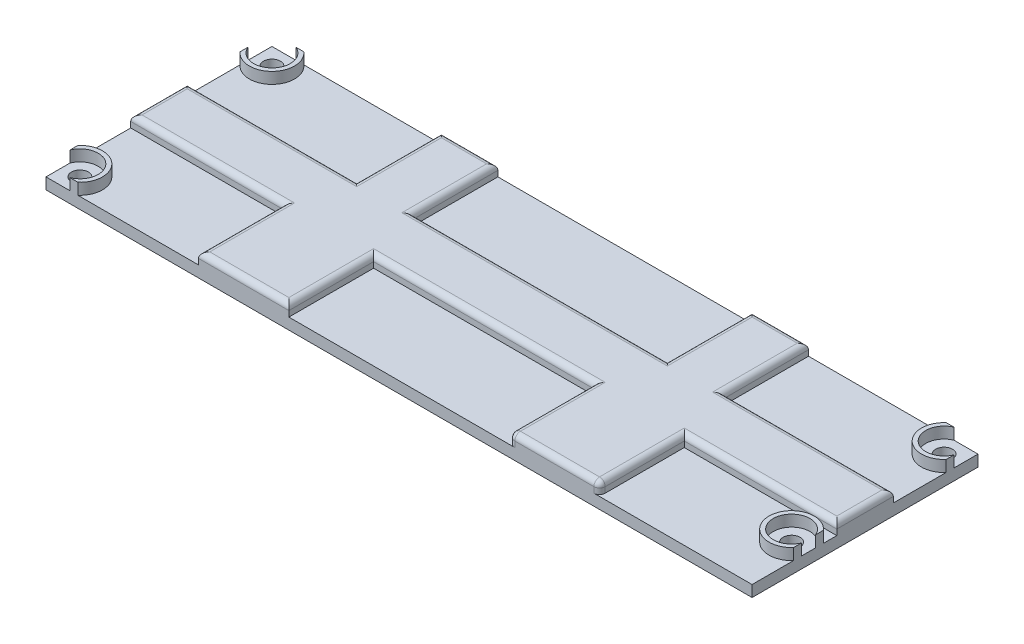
from build123d import *

# Parameters (mm, degrees)
SKETCH_1_W      = 125
SKETCH_1_H      = 40
SKETCH_1_R      = 1.5
EXTRUDE_1_DEPTH = 2
EXTRUDE_2_DEPTH = 2
EXTRUDE_3_DEPTH = 2
EXTRUDE_4_DEPTH = 2
EXTRUDE_5_DEPTH = 2
FILLET_1_R      = 1
FILLET_2_R      = 1


with BuildPart() as part:
    # Sketch 1 → Extrude 1 (new body)
    with BuildSketch(Plane(origin=(0, 0, 0), x_dir=(1, 0, 0), z_dir=(0, 1, 0))):
        with Locations((62.5, 20)):
            Rectangle(SKETCH_1_W, SKETCH_1_H)
        with Locations(Location((3, 37, 0), (0, 0, 270))):
            Circle(SKETCH_1_R, mode=Mode.SUBTRACT)
        with Locations(Location((3, 3, 0), (0, 0, 270))):
            Circle(SKETCH_1_R, mode=Mode.SUBTRACT)
        with Locations(Location((122, 37, 0), (0, 0, 270))):
            Circle(SKETCH_1_R, mode=Mode.SUBTRACT)
        with Locations(Location((122, 10, 0), (0, 0, 270))):
            Circle(SKETCH_1_R, mode=Mode.SUBTRACT)
    extrude(amount=-EXTRUDE_1_DEPTH)

    # Sketch 2 → Extrude 2 (add)
    with BuildSketch(Plane(origin=(0, 0, 0), x_dir=(1, 0, 0), z_dir=(0, 1, 0))):
        with BuildLine():
            ThreePointArc((0, 34.354248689), (5.828427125, 34.171572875), (5.645751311, 40))
            Line((5.645751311, 40), (4.25, 40))
            ThreePointArc((4.25, 40), (5.298097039, 34.701902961), (0, 35.75))
            Line((0, 35.75), (0, 34.354248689))
        make_face()
    extrude(amount=EXTRUDE_2_DEPTH)

    # Sketch 2_3 → Extrude 3 (add)
    with BuildSketch(Plane(origin=(0, 0, 0), x_dir=(1, 0, 0), z_dir=(0, 1, 0))):
        with BuildLine():
            ThreePointArc((5.645751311, 0), (5.828427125, 5.828427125), (0, 5.645751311))
            Line((0, 5.645751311), (0, 4.25))
            ThreePointArc((0, 4.25), (5.298097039, 5.298097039), (4.25, 0))
            Line((4.25, 0), (5.645751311, 0))
        make_face()
    extrude(amount=EXTRUDE_3_DEPTH)

    # Sketch 2_4 → Extrude 4 (add)
    with BuildSketch(Plane(origin=(0, 0, 0), x_dir=(1, 0, 0), z_dir=(0, 1, 0))):
        with BuildLine():
            ThreePointArc((119.354248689, 40), (119.171572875, 34.171572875), (125, 34.354248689))
            Line((125, 34.354248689), (125, 35.75))
            ThreePointArc((125, 35.75), (119.701902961, 34.701902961), (120.75, 40))
            Line((120.75, 40), (119.354248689, 40))
        make_face()
        with BuildLine():
            Line((125, 11.25), (125, 12.645751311))
            ThreePointArc((125, 12.645751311), (118, 10), (125, 7.354248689))
            Line((125, 7.354248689), (125, 8.75))
            ThreePointArc((125, 8.75), (118.75, 10), (125, 11.25))
        make_face()
    extrude(amount=EXTRUDE_4_DEPTH)

    # Sketch 3 → Extrude 5 (add)
    with BuildSketch(Plane(origin=(0, 0, 0), x_dir=(1, 0, 0), z_dir=(0, 1, 0))):
        Polygon((0, 25), (30, 25), (30, 40), (40, 40), (40, 25), (85, 25), (85, 40), (95, 40), (95, 25), (125, 25), (125, 15), (98, 15), (98, 0), (82, 0), (82, 15), (43, 15), (43, 0), (27, 0), (27, 15), (0, 15), align=None)
    extrude(amount=EXTRUDE_5_DEPTH)

    # Fillet 1
    fillet_1_edges = [part.edges().sort_by_distance(p)[0] for p in [
        (0, 2, -20),
        (15, 2, -25),
        (30, 2, -32.5),
        (35, 2, -40),
        (40, 2, -32.5),
        (62.5, 2, -25),
        (85, 2, -32.5),
        (95, 2, -32.5),
        (90, 2, -40),
        (125, 2, -20),
        (110, 2, -25),
        (111.5, 2, -15),
        (98, 2, -7.5),
        (82, 2, -7.5),
        (62.5, 2, -15),
        (43, 2, -7.5),
        (35, 2, 0),
        (27, 2, -7.5),
        (13.5, 2, -15),
    ]]
    fillet(fillet_1_edges, radius=FILLET_1_R)

    # Fillet 2
    fillet_2_edges = [part.edges().sort_by_distance(p)[0] for p in [
        (90, 2, 0),
        (98, 0.5, 0),
        (82, 0.5, 0),
        (82.292893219, 1.707106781, 0),
        (97.707106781, 1.707106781, 0),
    ]]
    fillet(fillet_2_edges, radius=FILLET_2_R)


solid = part.part
